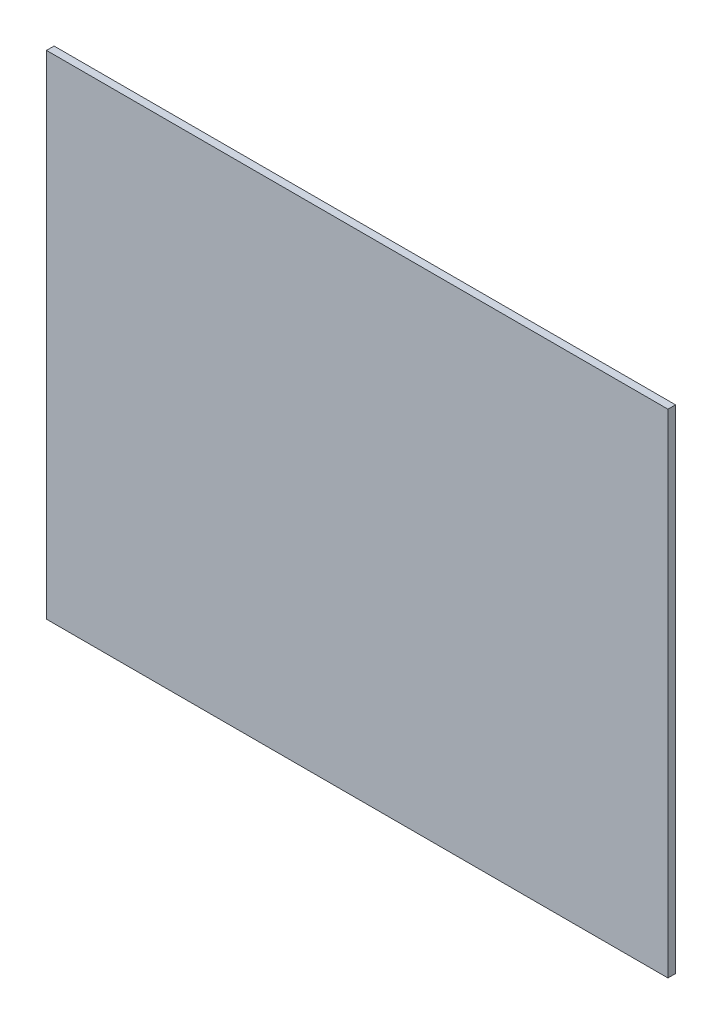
from build123d import *

# Parameters (mm, degrees)
SKETCH1_W      = 1041.4
SKETCH1_H      = 825.5
EXTRUDE1_DEPTH = 6.35


with BuildPart() as part:
    # Sketch1 → Extrude1 (new, symmetric)
    with BuildSketch(Plane.XY):
        Rectangle(SKETCH1_W, SKETCH1_H)
    extrude(amount=EXTRUDE1_DEPTH, both=True)


solid = part.part
